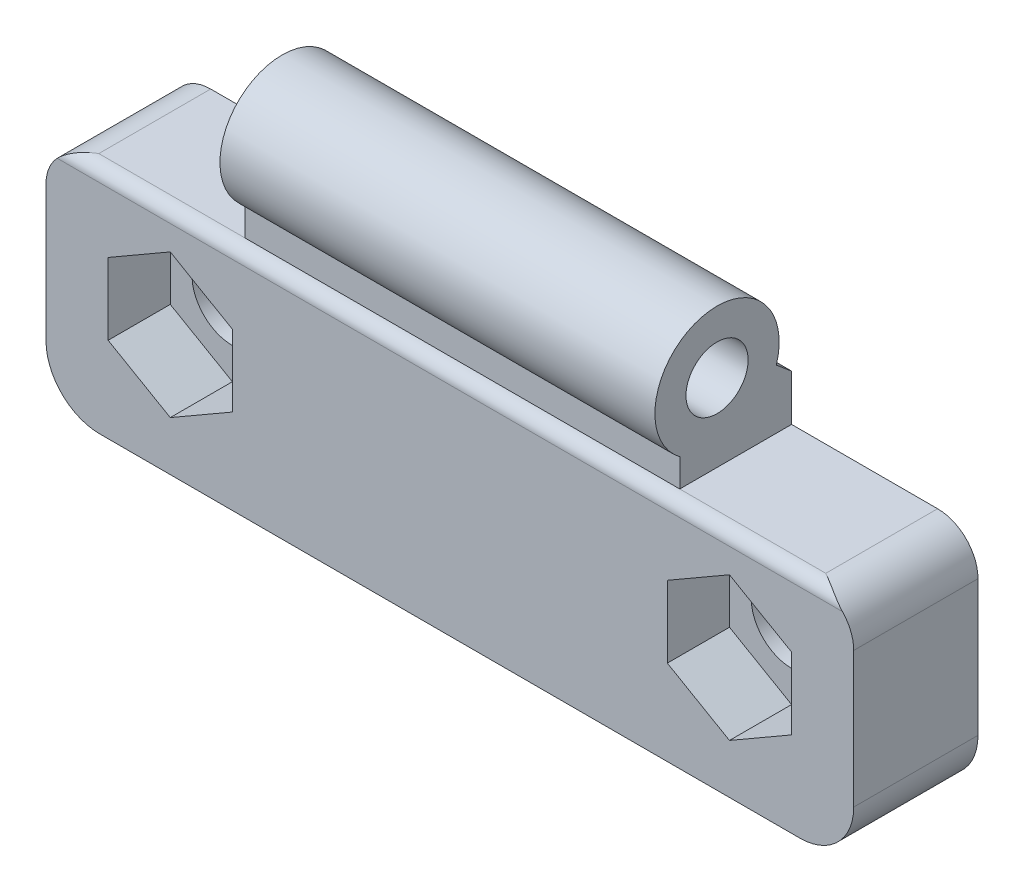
ISO-10303-21;
HEADER;
FILE_DESCRIPTION(('STEP AP214'),'2;1');
FILE_NAME('part.step','',(''),(''),'','','');
FILE_SCHEMA(('AUTOMOTIVE_DESIGN { 1 0 10303 214 1 1 1 1 }'));
ENDSEC;
DATA;
#1=APPLICATION_CONTEXT('core data for automotive mechanical design processes');
#2=APPLICATION_PROTOCOL_DEFINITION('international standard','automotive_design',2000,#1);
#3=PRODUCT_CONTEXT('',#1,'mechanical');
#4=PRODUCT('Part','Part','',(#3));
#5=PRODUCT_RELATED_PRODUCT_CATEGORY('part','',(#4));
#6=PRODUCT_DEFINITION_FORMATION('','',#4);
#7=PRODUCT_DEFINITION_CONTEXT('part definition',#1,'design');
#8=PRODUCT_DEFINITION('design','',#6,#7);
#9=PRODUCT_DEFINITION_SHAPE('','',#8);
#10=(LENGTH_UNIT() NAMED_UNIT(*) SI_UNIT(.MILLI.,.METRE.));
#11=(NAMED_UNIT(*) PLANE_ANGLE_UNIT() SI_UNIT($,.RADIAN.));
#12=(NAMED_UNIT(*) SI_UNIT($,.STERADIAN.) SOLID_ANGLE_UNIT());
#13=UNCERTAINTY_MEASURE_WITH_UNIT(LENGTH_MEASURE(1.E-05),#10,'distance_accuracy_value','');
#14=(GEOMETRIC_REPRESENTATION_CONTEXT(3) GLOBAL_UNCERTAINTY_ASSIGNED_CONTEXT((#13)) GLOBAL_UNIT_ASSIGNED_CONTEXT((#10,
#11,#12)) REPRESENTATION_CONTEXT('',''));
#15=CARTESIAN_POINT('',(0.,0.,0.));
#16=DIRECTION('',(0.,0.,1.));
#17=DIRECTION('',(1.,0.,0.));
#18=AXIS2_PLACEMENT_3D('',#15,#16,#17);
#19=CARTESIAN_POINT('',(45.,0.,5.));
#20=DIRECTION('',(0.,0.,1.));
#21=DIRECTION('',(1.,0.,0.));
#22=AXIS2_PLACEMENT_3D('',#19,#20,#21);
#23=CYLINDRICAL_SURFACE('',#22,3.25);
#24=CARTESIAN_POINT('',(45.,0.,0.));
#25=DIRECTION('',(0.,0.,1.));
#26=DIRECTION('',(1.,0.,0.));
#27=AXIS2_PLACEMENT_3D('',#24,#25,#26);
#28=CIRCLE('',#27,3.25);
#29=CARTESIAN_POINT('',(48.25,0.,0.));
#30=VERTEX_POINT('',#29);
#31=EDGE_CURVE('E313',#30,#30,#28,.F.);
#32=ORIENTED_EDGE('',*,*,#31,.T.);
#33=EDGE_LOOP('',(#32));
#34=FACE_BOUND('',#33,.T.);
#35=CARTESIAN_POINT('',(45.,0.,5.));
#36=DIRECTION('',(0.,0.,1.));
#37=DIRECTION('',(1.,0.,0.));
#38=AXIS2_PLACEMENT_3D('',#35,#36,#37);
#39=CIRCLE('',#38,3.25);
#40=CARTESIAN_POINT('',(48.25,0.,5.));
#41=VERTEX_POINT('',#40);
#42=EDGE_CURVE('E18',#41,#41,#39,.F.);
#43=ORIENTED_EDGE('',*,*,#42,.F.);
#44=EDGE_LOOP('',(#43));
#45=FACE_BOUND('',#44,.T.);
#46=ADVANCED_FACE('F14',(#34,#45),#23,.F.);
#47=CARTESIAN_POINT('',(0.,0.,5.));
#48=DIRECTION('',(0.,0.,1.));
#49=DIRECTION('',(1.,0.,0.));
#50=AXIS2_PLACEMENT_3D('',#47,#48,#49);
#51=CYLINDRICAL_SURFACE('',#50,3.25);
#52=CARTESIAN_POINT('',(0.,0.,0.));
#53=DIRECTION('',(0.,0.,1.));
#54=DIRECTION('',(1.,0.,0.));
#55=AXIS2_PLACEMENT_3D('',#52,#53,#54);
#56=CIRCLE('',#55,3.25);
#57=CARTESIAN_POINT('',(3.25,0.,0.));
#58=VERTEX_POINT('',#57);
#59=EDGE_CURVE('E325',#58,#58,#56,.F.);
#60=ORIENTED_EDGE('',*,*,#59,.T.);
#61=EDGE_LOOP('',(#60));
#62=FACE_BOUND('',#61,.T.);
#63=CARTESIAN_POINT('',(0.,0.,5.));
#64=DIRECTION('',(0.,0.,1.));
#65=DIRECTION('',(1.,0.,0.));
#66=AXIS2_PLACEMENT_3D('',#63,#64,#65);
#67=CIRCLE('',#66,3.25);
#68=CARTESIAN_POINT('',(3.25,0.,5.));
#69=VERTEX_POINT('',#68);
#70=EDGE_CURVE('E281',#69,#69,#67,.F.);
#71=ORIENTED_EDGE('',*,*,#70,.F.);
#72=EDGE_LOOP('',(#71));
#73=FACE_BOUND('',#72,.T.);
#74=ADVANCED_FACE('F474',(#62,#73),#51,.F.);
#75=CARTESIAN_POINT('',(40.,15.,6.));
#76=DIRECTION('',(1.,0.,0.));
#77=DIRECTION('',(0.,1.,0.));
#78=AXIS2_PLACEMENT_3D('',#75,#76,#77);
#79=CYLINDRICAL_SURFACE('',#78,5.);
#80=DIRECTION('',(1.,0.,0.));
#81=VECTOR('',#80,1.);
#82=CARTESIAN_POINT('',(40.,11.,9.));
#83=LINE('',#82,#81);
#84=CARTESIAN_POINT('',(40.,11.,9.));
#85=VERTEX_POINT('',#84);
#86=CARTESIAN_POINT('',(5.,11.,9.));
#87=VERTEX_POINT('',#86);
#88=EDGE_CURVE('E391',#85,#87,#83,.F.);
#89=ORIENTED_EDGE('',*,*,#88,.F.);
#90=CARTESIAN_POINT('',(40.,15.,6.));
#91=DIRECTION('',(1.,0.,0.));
#92=DIRECTION('',(0.,1.,0.));
#93=AXIS2_PLACEMENT_3D('',#90,#91,#92);
#94=CIRCLE('',#93,5.);
#95=CARTESIAN_POINT('',(40.,13.5,1.23030399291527));
#96=VERTEX_POINT('',#95);
#97=EDGE_CURVE('E382',#96,#85,#94,.T.);
#98=ORIENTED_EDGE('',*,*,#97,.F.);
#99=DIRECTION('',(1.,0.,0.));
#100=VECTOR('',#99,1.);
#101=CARTESIAN_POINT('',(40.,13.5,1.23030399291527));
#102=LINE('',#101,#100);
#103=CARTESIAN_POINT('',(5.,13.5,1.23030399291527));
#104=VERTEX_POINT('',#103);
#105=EDGE_CURVE('E377',#104,#96,#102,.T.);
#106=ORIENTED_EDGE('',*,*,#105,.F.);
#107=CARTESIAN_POINT('',(5.,15.,6.));
#108=DIRECTION('',(1.,0.,0.));
#109=DIRECTION('',(0.,1.,0.));
#110=AXIS2_PLACEMENT_3D('',#107,#108,#109);
#111=CIRCLE('',#110,5.);
#112=EDGE_CURVE('E363',#104,#87,#111,.T.);
#113=ORIENTED_EDGE('',*,*,#112,.T.);
#114=EDGE_LOOP('',(#89,#98,#106,#113));
#115=FACE_BOUND('',#114,.T.);
#116=ADVANCED_FACE('F16',(#115),#79,.T.);
#117=CARTESIAN_POINT('',(40.,11.,9.));
#118=DIRECTION('',(0.,0.,1.));
#119=DIRECTION('',(1.,0.,0.));
#120=AXIS2_PLACEMENT_3D('',#117,#118,#119);
#121=PLANE('',#120);
#122=ORIENTED_EDGE('',*,*,#88,.T.);
#123=DIRECTION('',(0.,1.,0.));
#124=VECTOR('',#123,1.);
#125=CARTESIAN_POINT('',(5.,15.,9.));
#126=LINE('',#125,#124);
#127=CARTESIAN_POINT('',(5.,8.75,9.));
#128=VERTEX_POINT('',#127);
#129=EDGE_CURVE('E360',#87,#128,#126,.F.);
#130=ORIENTED_EDGE('',*,*,#129,.T.);
#131=DIRECTION('',(1.,0.,0.));
#132=VECTOR('',#131,1.);
#133=CARTESIAN_POINT('',(55.,8.75,9.));
#134=LINE('',#133,#132);
#135=CARTESIAN_POINT('',(40.,8.75,9.));
#136=VERTEX_POINT('',#135);
#137=EDGE_CURVE('E390',#136,#128,#134,.F.);
#138=ORIENTED_EDGE('',*,*,#137,.F.);
#139=DIRECTION('',(0.,1.,0.));
#140=VECTOR('',#139,1.);
#141=CARTESIAN_POINT('',(40.,15.,9.));
#142=LINE('',#141,#140);
#143=EDGE_CURVE('E380',#85,#136,#142,.F.);
#144=ORIENTED_EDGE('',*,*,#143,.F.);
#145=EDGE_LOOP('',(#122,#130,#138,#144));
#146=FACE_BOUND('',#145,.T.);
#147=ADVANCED_FACE('F484',(#146),#121,.T.);
#148=CARTESIAN_POINT('',(40.,15.,6.));
#149=DIRECTION('',(1.,0.,0.));
#150=DIRECTION('',(0.,1.,0.));
#151=AXIS2_PLACEMENT_3D('',#148,#149,#150);
#152=CYLINDRICAL_SURFACE('',#151,2.5);
#153=CARTESIAN_POINT('',(5.,15.,6.));
#154=DIRECTION('',(1.,0.,0.));
#155=DIRECTION('',(0.,1.,0.));
#156=AXIS2_PLACEMENT_3D('',#153,#154,#155);
#157=CIRCLE('',#156,2.5);
#158=CARTESIAN_POINT('',(5.,17.5,6.));
#159=VERTEX_POINT('',#158);
#160=EDGE_CURVE('E353',#159,#159,#157,.F.);
#161=ORIENTED_EDGE('',*,*,#160,.T.);
#162=EDGE_LOOP('',(#161));
#163=FACE_BOUND('',#162,.T.);
#164=CARTESIAN_POINT('',(40.,15.,6.));
#165=DIRECTION('',(1.,0.,0.));
#166=DIRECTION('',(0.,1.,0.));
#167=AXIS2_PLACEMENT_3D('',#164,#165,#166);
#168=CIRCLE('',#167,2.5);
#169=CARTESIAN_POINT('',(40.,17.5,6.));
#170=VERTEX_POINT('',#169);
#171=EDGE_CURVE('E393',#170,#170,#168,.F.);
#172=ORIENTED_EDGE('',*,*,#171,.F.);
#173=EDGE_LOOP('',(#172));
#174=FACE_BOUND('',#173,.T.);
#175=ADVANCED_FACE('F706',(#163,#174),#152,.F.);
#176=CARTESIAN_POINT('',(22.5,15.,10.));
#177=DIRECTION('',(0.,0.,1.));
#178=DIRECTION('',(1.,0.,0.));
#179=AXIS2_PLACEMENT_3D('',#176,#177,#178);
#180=PLANE('',#179);
#181=DIRECTION('',(-0.866025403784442,0.5,0.));
#182=VECTOR('',#181,1.);
#183=CARTESIAN_POINT('',(50.,2.8867513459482,10.));
#184=LINE('',#183,#182);
#185=CARTESIAN_POINT('',(50.,2.8867513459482,10.));
#186=VERTEX_POINT('',#185);
#187=CARTESIAN_POINT('',(45.,5.77350269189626,10.));
#188=VERTEX_POINT('',#187);
#189=EDGE_CURVE('E31',#186,#188,#184,.T.);
#190=ORIENTED_EDGE('',*,*,#189,.F.);
#191=DIRECTION('',(0.,1.,0.));
#192=VECTOR('',#191,1.);
#193=CARTESIAN_POINT('',(50.,-2.8867513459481,10.));
#194=LINE('',#193,#192);
#195=CARTESIAN_POINT('',(50.,-2.8867513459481,10.));
#196=VERTEX_POINT('',#195);
#197=EDGE_CURVE('E211',#196,#186,#194,.T.);
#198=ORIENTED_EDGE('',*,*,#197,.F.);
#199=DIRECTION('',(0.866025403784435,0.500000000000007,0.));
#200=VECTOR('',#199,1.);
#201=CARTESIAN_POINT('',(45.,-5.77350269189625,10.));
#202=LINE('',#201,#200);
#203=CARTESIAN_POINT('',(45.,-5.77350269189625,10.));
#204=VERTEX_POINT('',#203);
#205=EDGE_CURVE('E214',#204,#196,#202,.T.);
#206=ORIENTED_EDGE('',*,*,#205,.F.);
#207=DIRECTION('',(0.866025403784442,-0.5,0.));
#208=VECTOR('',#207,1.);
#209=CARTESIAN_POINT('',(40.,-2.88675134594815,10.));
#210=LINE('',#209,#208);
#211=CARTESIAN_POINT('',(40.,-2.88675134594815,10.));
#212=VERTEX_POINT('',#211);
#213=EDGE_CURVE('E230',#212,#204,#210,.T.);
#214=ORIENTED_EDGE('',*,*,#213,.F.);
#215=DIRECTION('',(0.,-1.,0.));
#216=VECTOR('',#215,1.);
#217=CARTESIAN_POINT('',(40.,2.88675134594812,10.));
#218=LINE('',#217,#216);
#219=CARTESIAN_POINT('',(40.,2.88675134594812,10.));
#220=VERTEX_POINT('',#219);
#221=EDGE_CURVE('E227',#220,#212,#218,.T.);
#222=ORIENTED_EDGE('',*,*,#221,.F.);
#223=DIRECTION('',(-0.866025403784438,-0.5,0.));
#224=VECTOR('',#223,1.);
#225=CARTESIAN_POINT('',(45.,5.77350269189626,10.));
#226=LINE('',#225,#224);
#227=EDGE_CURVE('E225',#188,#220,#226,.T.);
#228=ORIENTED_EDGE('',*,*,#227,.F.);
#229=EDGE_LOOP('',(#190,#198,#206,#214,#222,#228));
#230=FACE_BOUND('',#229,.T.);
#231=DIRECTION('',(-0.866025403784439,0.5,0.));
#232=VECTOR('',#231,1.);
#233=CARTESIAN_POINT('',(5.,2.88675134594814,10.));
#234=LINE('',#233,#232);
#235=CARTESIAN_POINT('',(5.,2.88675134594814,10.));
#236=VERTEX_POINT('',#235);
#237=CARTESIAN_POINT('',(0.,5.77350269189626,10.));
#238=VERTEX_POINT('',#237);
#239=EDGE_CURVE('E39',#236,#238,#234,.T.);
#240=ORIENTED_EDGE('',*,*,#239,.F.);
#241=DIRECTION('',(0.,1.,0.));
#242=VECTOR('',#241,1.);
#243=CARTESIAN_POINT('',(5.,-2.8867513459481,10.));
#244=LINE('',#243,#242);
#245=CARTESIAN_POINT('',(5.,-2.8867513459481,10.));
#246=VERTEX_POINT('',#245);
#247=EDGE_CURVE('E248',#246,#236,#244,.T.);
#248=ORIENTED_EDGE('',*,*,#247,.F.);
#249=DIRECTION('',(0.866025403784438,0.5,0.));
#250=VECTOR('',#249,1.);
#251=CARTESIAN_POINT('',(0.,-5.77350269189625,10.));
#252=LINE('',#251,#250);
#253=CARTESIAN_POINT('',(0.,-5.77350269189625,10.));
#254=VERTEX_POINT('',#253);
#255=EDGE_CURVE('E274',#254,#246,#252,.T.);
#256=ORIENTED_EDGE('',*,*,#255,.F.);
#257=DIRECTION('',(0.866025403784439,-0.5,0.));
#258=VECTOR('',#257,1.);
#259=CARTESIAN_POINT('',(-5.,-2.88675134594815,10.));
#260=LINE('',#259,#258);
#261=CARTESIAN_POINT('',(-5.,-2.88675134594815,10.));
#262=VERTEX_POINT('',#261);
#263=EDGE_CURVE('E271',#262,#254,#260,.T.);
#264=ORIENTED_EDGE('',*,*,#263,.F.);
#265=DIRECTION('',(0.,-1.,0.));
#266=VECTOR('',#265,1.);
#267=CARTESIAN_POINT('',(-5.,2.88675134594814,10.));
#268=LINE('',#267,#266);
#269=CARTESIAN_POINT('',(-5.,2.88675134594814,10.));
#270=VERTEX_POINT('',#269);
#271=EDGE_CURVE('E268',#270,#262,#268,.T.);
#272=ORIENTED_EDGE('',*,*,#271,.F.);
#273=DIRECTION('',(-0.866025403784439,-0.5,0.));
#274=VECTOR('',#273,1.);
#275=CARTESIAN_POINT('',(0.,5.77350269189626,10.));
#276=LINE('',#275,#274);
#277=EDGE_CURVE('E265',#238,#270,#276,.T.);
#278=ORIENTED_EDGE('',*,*,#277,.F.);
#279=EDGE_LOOP('',(#240,#248,#256,#264,#272,#278));
#280=FACE_BOUND('',#279,.T.);
#281=CARTESIAN_POINT('',(51.75,5.5,10.));
#282=DIRECTION('',(0.,0.,-1.));
#283=DIRECTION('',(-1.,0.,0.));
#284=AXIS2_PLACEMENT_3D('',#281,#282,#283);
#285=CIRCLE('',#284,3.25);
#286=CARTESIAN_POINT('',(54.0952078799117,7.75,10.));
#287=VERTEX_POINT('',#286);
#288=CARTESIAN_POINT('',(55.,5.5,10.));
#289=VERTEX_POINT('',#288);
#290=EDGE_CURVE('E329',#287,#289,#285,.T.);
#291=ORIENTED_EDGE('',*,*,#290,.F.);
#292=DIRECTION('',(1.,0.,0.));
#293=VECTOR('',#292,1.);
#294=CARTESIAN_POINT('',(55.,7.75,10.));
#295=LINE('',#294,#293);
#296=CARTESIAN_POINT('',(-9.0952078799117,7.75,10.));
#297=VERTEX_POINT('',#296);
#298=EDGE_CURVE('E388',#297,#287,#295,.T.);
#299=ORIENTED_EDGE('',*,*,#298,.F.);
#300=CARTESIAN_POINT('',(-6.75,5.5,10.));
#301=DIRECTION('',(0.,0.,-1.));
#302=DIRECTION('',(-1.,0.,0.));
#303=AXIS2_PLACEMENT_3D('',#300,#301,#302);
#304=CIRCLE('',#303,3.25);
#305=CARTESIAN_POINT('',(-10.,5.5,10.));
#306=VERTEX_POINT('',#305);
#307=EDGE_CURVE('E348',#306,#297,#304,.T.);
#308=ORIENTED_EDGE('',*,*,#307,.F.);
#309=DIRECTION('',(0.,-1.,0.));
#310=VECTOR('',#309,1.);
#311=CARTESIAN_POINT('',(-10.,-5.4166666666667,10.));
#312=LINE('',#311,#310);
#313=CARTESIAN_POINT('',(-10.,-5.4166666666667,10.));
#314=VERTEX_POINT('',#313);
#315=EDGE_CURVE('E345',#314,#306,#312,.F.);
#316=ORIENTED_EDGE('',*,*,#315,.F.);
#317=CARTESIAN_POINT('',(-5.6666666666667,-5.4166666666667,10.));
#318=DIRECTION('',(0.,0.,-1.));
#319=DIRECTION('',(-1.,0.,0.));
#320=AXIS2_PLACEMENT_3D('',#317,#318,#319);
#321=CIRCLE('',#320,4.33333333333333);
#322=CARTESIAN_POINT('',(-5.6666666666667,-9.75,10.));
#323=VERTEX_POINT('',#322);
#324=EDGE_CURVE('E342',#323,#314,#321,.T.);
#325=ORIENTED_EDGE('',*,*,#324,.F.);
#326=DIRECTION('',(1.,0.,0.));
#327=VECTOR('',#326,1.);
#328=CARTESIAN_POINT('',(50.6666666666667,-9.75,10.));
#329=LINE('',#328,#327);
#330=CARTESIAN_POINT('',(50.6666666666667,-9.75,10.));
#331=VERTEX_POINT('',#330);
#332=EDGE_CURVE('E339',#331,#323,#329,.F.);
#333=ORIENTED_EDGE('',*,*,#332,.F.);
#334=CARTESIAN_POINT('',(50.6666666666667,-5.4166666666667,10.));
#335=DIRECTION('',(0.,0.,-1.));
#336=DIRECTION('',(-1.,0.,0.));
#337=AXIS2_PLACEMENT_3D('',#334,#335,#336);
#338=CIRCLE('',#337,4.33333333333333);
#339=CARTESIAN_POINT('',(55.,-5.4166666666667,10.));
#340=VERTEX_POINT('',#339);
#341=EDGE_CURVE('E336',#340,#331,#338,.T.);
#342=ORIENTED_EDGE('',*,*,#341,.F.);
#343=DIRECTION('',(0.,1.,0.));
#344=VECTOR('',#343,1.);
#345=CARTESIAN_POINT('',(55.,5.5,10.));
#346=LINE('',#345,#344);
#347=EDGE_CURVE('E333',#289,#340,#346,.F.);
#348=ORIENTED_EDGE('',*,*,#347,.F.);
#349=EDGE_LOOP('',(#291,#299,#308,#316,#325,#333,#342,#348));
#350=FACE_BOUND('',#349,.T.);
#351=ADVANCED_FACE('F438',(#230,#280,#350),#180,.T.);
#352=CARTESIAN_POINT('',(55.,7.75,9.));
#353=DIRECTION('',(1.,0.,0.));
#354=DIRECTION('',(0.,1.,0.));
#355=AXIS2_PLACEMENT_3D('',#352,#353,#354);
#356=CYLINDRICAL_SURFACE('',#355,1.);
#357=ORIENTED_EDGE('',*,*,#137,.T.);
#358=DIRECTION('',(-1.,0.,0.));
#359=VECTOR('',#358,1.);
#360=CARTESIAN_POINT('',(-6.75,8.75,9.));
#361=LINE('',#360,#359);
#362=CARTESIAN_POINT('',(-6.75,8.75,9.));
#363=VERTEX_POINT('',#362);
#364=EDGE_CURVE('E352',#363,#128,#361,.F.);
#365=ORIENTED_EDGE('',*,*,#364,.F.);
#366=CARTESIAN_POINT('',(-9.0952078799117,7.75,10.));
#367=CARTESIAN_POINT('',(-9.05730541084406,7.7895153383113,9.9999877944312));
#368=CARTESIAN_POINT('',(-9.01844303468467,7.82801385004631,9.99766050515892));
#369=CARTESIAN_POINT('',(-8.9391426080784,7.90272925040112,9.98898430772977));
#370=CARTESIAN_POINT('',(-8.89870771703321,7.93895036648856,9.9826431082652));
#371=CARTESIAN_POINT('',(-8.77612768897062,8.04337299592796,9.95864810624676));
#372=CARTESIAN_POINT('',(-8.69196734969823,8.10810030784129,9.93599885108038));
#373=CARTESIAN_POINT('',(-8.54229248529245,8.21223956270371,9.88809834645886));
#374=CARTESIAN_POINT('',(-8.47756518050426,8.25387573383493,9.86502360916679));
#375=CARTESIAN_POINT('',(-8.34656824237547,8.33183254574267,9.81463038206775));
#376=CARTESIAN_POINT('',(-8.28029817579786,8.3681516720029,9.78731068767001));
#377=CARTESIAN_POINT('',(-8.07896601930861,8.46968556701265,9.70004516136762));
#378=CARTESIAN_POINT('',(-7.94205678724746,8.52701481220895,9.63502639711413));
#379=CARTESIAN_POINT('',(-7.71806304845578,8.60380340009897,9.52318018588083));
#380=CARTESIAN_POINT('',(-7.63173288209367,8.62938347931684,9.47878152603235));
#381=CARTESIAN_POINT('',(-7.45833118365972,8.67313159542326,9.38778607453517));
#382=CARTESIAN_POINT('',(-7.37125941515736,8.69129717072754,9.34118855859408));
#383=CARTESIAN_POINT('',(-7.10989463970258,8.73482587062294,9.199610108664));
#384=CARTESIAN_POINT('',(-6.93477453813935,8.74944876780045,9.10249403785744));
#385=CARTESIAN_POINT('',(-6.75664691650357,8.74999489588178,9.00368703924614));
#386=CARTESIAN_POINT('',(-6.75332339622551,8.74999999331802,9.00184348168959));
#387=CARTESIAN_POINT('',(-6.75,8.75,9.));
#388=B_SPLINE_CURVE_WITH_KNOTS('',3,(#366,#367,#368,#369,#370,#371,#372,#373,#374,#375,#376,
#377,#378,#379,#380,#381,#382,#383,#384,#385,#386,#387),.UNSPECIFIED.,.F.,.F.,(4,2,2,2,2,2,2,2,
2,2,4),(0.,0.164087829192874,0.327861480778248,0.652251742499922,0.893004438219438,
1.13382557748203,1.61798965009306,1.91890595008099,2.21992207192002,2.81958905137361,
2.83099081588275),.UNSPECIFIED.);
#389=EDGE_CURVE('E349',#297,#363,#388,.T.);
#390=ORIENTED_EDGE('',*,*,#389,.F.);
#391=ORIENTED_EDGE('',*,*,#298,.T.);
#392=CARTESIAN_POINT('',(51.75,8.75,9.));
#393=CARTESIAN_POINT('',(51.750000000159,8.75,9.00000117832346));
#394=CARTESIAN_POINT('',(51.7500001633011,8.74999999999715,9.00000235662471));
#395=CARTESIAN_POINT('',(51.7500007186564,8.74999999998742,9.00000466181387));
#396=CARTESIAN_POINT('',(51.7500011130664,8.74999999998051,9.00000578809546));
#397=CARTESIAN_POINT('',(51.7500020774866,8.7499999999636,9.00000801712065));
#398=CARTESIAN_POINT('',(51.7500026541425,8.74999999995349,9.00000911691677));
#399=CARTESIAN_POINT('',(51.7500039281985,8.74999999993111,9.00001123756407));
#400=CARTESIAN_POINT('',(51.7500046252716,8.74999999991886,9.00001225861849));
#401=CARTESIAN_POINT('',(51.7500070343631,8.74999999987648,9.00001550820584));
#402=CARTESIAN_POINT('',(51.7500089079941,8.74999999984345,9.00001761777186));
#403=CARTESIAN_POINT('',(51.750012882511,8.74999999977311,9.00002152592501));
#404=CARTESIAN_POINT('',(51.7500149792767,8.74999999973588,9.0000233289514));
#405=CARTESIAN_POINT('',(51.7500227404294,8.74999999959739,9.00002964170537));
#406=CARTESIAN_POINT('',(51.7500286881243,8.74999999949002,9.00003381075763));
#407=CARTESIAN_POINT('',(51.7500407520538,8.74999999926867,9.00004104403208));
#408=CARTESIAN_POINT('',(51.750046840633,8.7499999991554,9.00004415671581));
#409=CARTESIAN_POINT('',(51.7500714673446,8.74999999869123,9.00005650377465));
#410=CARTESIAN_POINT('',(51.7500901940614,8.74999999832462,9.00006534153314));
#411=CARTESIAN_POINT('',(51.7501260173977,8.74999999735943,9.00008036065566));
#412=CARTESIAN_POINT('',(51.7501430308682,8.74999999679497,9.0000867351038));
#413=CARTESIAN_POINT('',(51.7502605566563,8.74999999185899,9.00013459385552));
#414=CARTESIAN_POINT('',(51.750353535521,8.74999998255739,9.00019236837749));
#415=CARTESIAN_POINT('',(51.7507067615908,8.74999993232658,9.00040313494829));
#416=CARTESIAN_POINT('',(51.7509723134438,8.74999986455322,9.00054402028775));
#417=CARTESIAN_POINT('',(51.751973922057,8.74999948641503,9.00108409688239));
#418=CARTESIAN_POINT('',(51.7527045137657,8.74999895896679,9.00149587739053));
#419=CARTESIAN_POINT('',(51.755609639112,8.74999587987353,9.00312450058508));
#420=CARTESIAN_POINT('',(51.7577901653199,8.74999138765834,9.00432740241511));
#421=CARTESIAN_POINT('',(51.8142959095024,8.74981822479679,9.03551019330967));
#422=CARTESIAN_POINT('',(51.8685340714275,8.74829247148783,9.06570560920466));
#423=CARTESIAN_POINT('',(51.9752670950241,8.7426091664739,9.12484934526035));
#424=CARTESIAN_POINT('',(52.0277621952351,8.73853740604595,9.15380664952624));
#425=CARTESIAN_POINT('',(52.138025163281,8.72727707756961,9.21440766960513));
#426=CARTESIAN_POINT('',(52.1957815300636,8.71981163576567,9.24602225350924));
#427=CARTESIAN_POINT('',(52.3116164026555,8.70164845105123,9.3089473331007));
#428=CARTESIAN_POINT('',(52.3696933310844,8.69092311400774,9.34025277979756));
#429=CARTESIAN_POINT('',(52.4726690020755,8.66896978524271,9.39517476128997));
#430=CARTESIAN_POINT('',(52.5176206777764,8.65838628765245,9.41895027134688));
#431=CARTESIAN_POINT('',(52.6072273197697,8.63525089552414,9.46584668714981));
#432=CARTESIAN_POINT('',(52.6518827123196,8.622703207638,9.4889688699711));
#433=CARTESIAN_POINT('',(52.7838215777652,8.58254100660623,9.5563986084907));
#434=CARTESIAN_POINT('',(52.8707827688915,8.55204531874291,9.59968582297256));
#435=CARTESIAN_POINT('',(53.0153504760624,8.49421605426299,9.66892817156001));
#436=CARTESIAN_POINT('',(53.0733294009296,8.46906521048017,9.69595094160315));
#437=CARTESIAN_POINT('',(53.1887786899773,8.41487555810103,9.74790084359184));
#438=CARTESIAN_POINT('',(53.2462457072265,8.38582017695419,9.77281826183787));
#439=CARTESIAN_POINT('',(53.3626154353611,8.32250617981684,9.8209038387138));
#440=CARTESIAN_POINT('',(53.4214764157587,8.28807974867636,9.84395383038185));
#441=CARTESIAN_POINT('',(53.5377651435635,8.21497829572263,9.88632781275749));
#442=CARTESIAN_POINT('',(53.5951947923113,8.17630932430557,9.90565700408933));
#443=CARTESIAN_POINT('',(53.7325786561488,8.07716921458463,9.94707942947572));
#444=CARTESIAN_POINT('',(53.8116625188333,8.01444633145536,9.96681970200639));
#445=CARTESIAN_POINT('',(53.9641010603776,7.88125053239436,9.99364572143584));
#446=CARTESIAN_POINT('',(54.0375069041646,7.81086530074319,10.0008613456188));
#447=CARTESIAN_POINT('',(54.1590949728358,7.68275441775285,9.99922091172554));
#448=CARTESIAN_POINT('',(54.2088674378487,7.62650578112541,9.99406109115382));
#449=CARTESIAN_POINT('',(54.3035682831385,7.51178953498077,9.97295942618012));
#450=CARTESIAN_POINT('',(54.3484947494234,7.453321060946,9.95701333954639));
#451=CARTESIAN_POINT('',(54.4247440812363,7.34708824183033,9.91667212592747));
#452=CARTESIAN_POINT('',(54.4570632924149,7.2992779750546,9.89429577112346));
#453=CARTESIAN_POINT('',(54.5169680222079,7.20571577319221,9.84062859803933));
#454=CARTESIAN_POINT('',(54.5445566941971,7.15996248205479,9.8093437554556));
#455=CARTESIAN_POINT('',(54.5947264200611,7.07244933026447,9.73765989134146));
#456=CARTESIAN_POINT('',(54.6172752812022,7.0307160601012,9.69720542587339));
#457=CARTESIAN_POINT('',(54.6569565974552,6.95395246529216,9.60808018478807));
#458=CARTESIAN_POINT('',(54.6740907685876,6.9189200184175,9.55941201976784));
#459=CARTESIAN_POINT('',(54.7014522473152,6.86100920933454,9.46107729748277));
#460=CARTESIAN_POINT('',(54.7122281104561,6.83722330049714,9.41209515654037));
#461=CARTESIAN_POINT('',(54.7297159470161,6.797791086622,9.31028193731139));
#462=CARTESIAN_POINT('',(54.7364292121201,6.78214219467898,9.2574520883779));
#463=CARTESIAN_POINT('',(54.7457170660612,6.76028307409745,9.15231432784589));
#464=CARTESIAN_POINT('',(54.748482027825,6.75363952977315,9.10011269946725));
#465=CARTESIAN_POINT('',(54.750569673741,6.74863517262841,8.99524785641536));
#466=CARTESIAN_POINT('',(54.7498927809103,6.75027334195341,8.94258469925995));
#467=CARTESIAN_POINT('',(54.7451041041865,6.76170045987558,8.83889265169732));
#468=CARTESIAN_POINT('',(54.7410296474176,6.77140082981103,8.78785223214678));
#469=CARTESIAN_POINT('',(54.7293931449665,6.79843412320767,8.68825570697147));
#470=CARTESIAN_POINT('',(54.7218312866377,6.81576663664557,8.63969946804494));
#471=CARTESIAN_POINT('',(54.70303954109,6.85741604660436,8.54621298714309));
#472=CARTESIAN_POINT('',(54.6917952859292,6.8817602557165,8.50129782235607));
#473=CARTESIAN_POINT('',(54.6655269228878,6.93635552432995,8.41645198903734));
#474=CARTESIAN_POINT('',(54.650502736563,6.96660670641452,8.37652142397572));
#475=CARTESIAN_POINT('',(54.6162062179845,7.03257126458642,8.30153498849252));
#476=CARTESIAN_POINT('',(54.5968345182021,7.06840516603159,8.26663099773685));
#477=CARTESIAN_POINT('',(54.5541983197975,7.14342108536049,8.20346430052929));
#478=CARTESIAN_POINT('',(54.5309333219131,7.1826035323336,8.17520244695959));
#479=CARTESIAN_POINT('',(54.4788589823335,7.26590351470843,8.12351113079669));
#480=CARTESIAN_POINT('',(54.4497624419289,7.31016969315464,8.10061311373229));
#481=CARTESIAN_POINT('',(54.3878223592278,7.39930311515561,8.06225140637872));
#482=CARTESIAN_POINT('',(54.3549750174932,7.44417092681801,8.04679533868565));
#483=CARTESIAN_POINT('',(54.2701213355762,7.5538339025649,8.01711213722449));
#484=CARTESIAN_POINT('',(54.2162745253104,7.61825889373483,8.00675166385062));
#485=CARTESIAN_POINT('',(54.1034197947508,7.74299627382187,7.99806667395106));
#486=CARTESIAN_POINT('',(54.0444133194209,7.80330980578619,7.99973879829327));
#487=CARTESIAN_POINT('',(53.8971239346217,7.94262986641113,8.01529312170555));
#488=CARTESIAN_POINT('',(53.806863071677,8.01899156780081,8.03395966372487));
#489=CARTESIAN_POINT('',(53.6199229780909,8.16081113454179,8.08511775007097));
#490=CARTESIAN_POINT('',(53.5231687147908,8.22609155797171,8.11780914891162));
#491=CARTESIAN_POINT('',(53.3494770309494,8.33052583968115,8.18400406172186));
#492=CARTESIAN_POINT('',(53.2732539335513,8.37220929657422,8.21549370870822));
#493=CARTESIAN_POINT('',(53.1191347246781,8.44879473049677,8.28285773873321));
#494=CARTESIAN_POINT('',(53.0412354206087,8.48368220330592,8.31874123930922));
#495=CARTESIAN_POINT('',(52.8890101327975,8.54491064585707,8.39152526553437));
#496=CARTESIAN_POINT('',(52.8147474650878,8.57163673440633,8.42823810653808));
#497=CARTESIAN_POINT('',(52.6659855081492,8.61921919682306,8.50358292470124));
#498=CARTESIAN_POINT('',(52.5914909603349,8.64011289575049,8.54220074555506));
#499=CARTESIAN_POINT('',(52.4619813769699,8.67155458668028,8.61045314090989));
#500=CARTESIAN_POINT('',(52.4070811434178,8.68337518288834,8.63973024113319));
#501=CARTESIAN_POINT('',(52.2958918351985,8.70433625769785,8.69955351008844));
#502=CARTESIAN_POINT('',(52.2395982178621,8.71341384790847,8.73011342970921));
#503=CARTESIAN_POINT('',(52.1463818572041,8.72595159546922,8.78102876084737));
#504=CARTESIAN_POINT('',(52.1095002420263,8.73026850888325,8.80125407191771));
#505=CARTESIAN_POINT('',(52.036010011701,8.7375995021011,8.84168076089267));
#506=CARTESIAN_POINT('',(51.9994017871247,8.74062450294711,8.86188083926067));
#507=CARTESIAN_POINT('',(51.9295353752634,8.74520810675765,8.90048050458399));
#508=CARTESIAN_POINT('',(51.8962805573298,8.74687647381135,8.91887378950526));
#509=CARTESIAN_POINT('',(51.8286924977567,8.74922916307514,8.95637649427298));
#510=CARTESIAN_POINT('',(51.794359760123,8.74987931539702,8.97548957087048));
#511=CARTESIAN_POINT('',(51.757791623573,8.74999138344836,8.9956719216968));
#512=CARTESIAN_POINT('',(51.7556124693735,8.74999587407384,8.99687396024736));
#513=CARTESIAN_POINT('',(51.7527077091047,8.7499989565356,8.99850234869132));
#514=CARTESIAN_POINT('',(51.7519760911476,8.74999948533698,8.99891471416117));
#515=CARTESIAN_POINT('',(51.750973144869,8.74999986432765,8.99945551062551));
#516=CARTESIAN_POINT('',(51.7507072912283,8.74999993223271,8.99959655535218));
#517=CARTESIAN_POINT('',(51.7503537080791,8.74999998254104,8.99980753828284));
#518=CARTESIAN_POINT('',(51.7502606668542,8.74999999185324,8.99986535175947));
#519=CARTESIAN_POINT('',(51.750143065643,8.74999999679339,8.99991323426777));
#520=CARTESIAN_POINT('',(51.7501260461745,8.74999999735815,8.99991960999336));
#521=CARTESIAN_POINT('',(51.750090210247,8.74999999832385,8.99993463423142));
#522=CARTESIAN_POINT('',(51.7500714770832,8.74999999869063,8.99994347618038));
#523=CARTESIAN_POINT('',(51.7500468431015,8.74999999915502,8.9999558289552));
#524=CARTESIAN_POINT('',(51.7500407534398,8.74999999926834,8.99995894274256));
#525=CARTESIAN_POINT('',(51.7500286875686,8.74999999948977,8.99996617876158));
#526=CARTESIAN_POINT('',(51.7500227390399,8.74999999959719,8.99997034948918));
#527=CARTESIAN_POINT('',(51.7500149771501,8.74999999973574,8.9999766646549));
#528=CARTESIAN_POINT('',(51.7500128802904,8.74999999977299,8.99997846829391));
#529=CARTESIAN_POINT('',(51.7500089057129,8.74999999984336,8.99998237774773));
#530=CARTESIAN_POINT('',(51.750007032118,8.7499999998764,8.99998448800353));
#531=CARTESIAN_POINT('',(51.7500046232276,8.7499999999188,8.99998773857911));
#532=CARTESIAN_POINT('',(51.7500039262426,8.74999999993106,8.9999887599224));
#533=CARTESIAN_POINT('',(51.7500026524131,8.74999999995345,8.99999088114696));
#534=CARTESIAN_POINT('',(51.7500020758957,8.74999999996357,8.99999198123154));
#535=CARTESIAN_POINT('',(51.7500011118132,8.7499999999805,8.99999421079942));
#536=CARTESIAN_POINT('',(51.7500007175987,8.74999999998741,8.99999533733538));
#537=CARTESIAN_POINT('',(51.7500001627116,8.74999999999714,8.99999764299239));
#538=CARTESIAN_POINT('',(51.7499999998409,8.75,8.9999988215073));
#539=CARTESIAN_POINT('',(51.75,8.75,9.));
#540=B_SPLINE_CURVE_WITH_KNOTS('',3,(#392,#393,#394,#395,#396,#397,#398,#399,#400,#401,#402,
#403,#404,#405,#406,#407,#408,#409,#410,#411,#412,#413,#414,#415,#416,#417,#418,#419,#420,#421,
#422,#423,#424,#425,#426,#427,#428,#429,#430,#431,#432,#433,#434,#435,#436,#437,#438,#439,#440,
#441,#442,#443,#444,#445,#446,#447,#448,#449,#450,#451,#452,#453,#454,#455,#456,#457,#458,#459,
#460,#461,#462,#463,#464,#465,#466,#467,#468,#469,#470,#471,#472,#473,#474,#475,#476,#477,#478,
#479,#480,#481,#482,#483,#484,#485,#486,#487,#488,#489,#490,#491,#492,#493,#494,#495,#496,#497,
#498,#499,#500,#501,#502,#503,#504,#505,#506,#507,#508,#509,#510,#511,#512,#513,#514,#515,#516,
#517,#518,#519,#520,#521,#522,#523,#524,#525,#526,#527,#528,#529,#530,#531,#532,#533,#534,#535,
#536,#537,#538,#539),.UNSPECIFIED.,.T.,.F.,(4,2,2,2,2,2,2,2,2,2,2,2,2,2,2,2,2,2,2,2,2,2,2,2,2,2,
2,2,2,2,2,2,2,2,2,2,2,2,2,2,2,2,2,2,2,2,2,2,2,2,2,2,2,2,2,2,2,2,2,2,2,2,2,2,2,2,2,2,2,2,2,2,2,
4),(0.,3.53115691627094E-06,7.09641137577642E-06,1.08105630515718E-05,1.45147823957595E-05,
2.29382984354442E-05,3.1226912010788E-05,5.29263216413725E-05,7.34219142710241E-05,
0.000135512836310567,0.00018995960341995,0.000516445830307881,0.00141973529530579,
0.00393389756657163,0.0114065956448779,0.19759245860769,0.377819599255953,0.576534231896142,
0.776980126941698,0.932762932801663,1.08821655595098,1.39323247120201,1.59931412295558,
1.80629986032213,2.02201901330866,2.23743442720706,2.5449721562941,2.84930131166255,
3.07437204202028,3.29953134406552,3.48445927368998,3.66926344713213,3.85521634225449,
4.04111024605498,4.20678395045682,4.37240495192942,4.52973428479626,4.6870442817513,
4.84264842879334,4.99824421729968,5.15445448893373,5.3106680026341,5.4709013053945,
5.63115517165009,5.80360488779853,5.97623086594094,6.22860879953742,6.48091627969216,
6.83805128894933,7.20045395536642,7.47729774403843,7.75472605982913,8.01564030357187,
8.27484437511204,8.46477475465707,8.65877682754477,8.78561256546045,8.91135380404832,
9.02546329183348,9.14332582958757,9.15079369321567,9.15331139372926,9.15421570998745,
9.15454241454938,9.15459687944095,9.15465899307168,9.15467949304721,9.15470119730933,
9.15470948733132,9.15471791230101,9.15472161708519,9.15472533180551,9.15472889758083,
9.15473242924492),.UNSPECIFIED.);
#541=CARTESIAN_POINT('',(51.75,8.75,9.));
#542=VERTEX_POINT('',#541);
#543=EDGE_CURVE('E332',#542,#287,#540,.T.);
#544=ORIENTED_EDGE('',*,*,#543,.F.);
#545=DIRECTION('',(-1.,0.,0.));
#546=VECTOR('',#545,1.);
#547=CARTESIAN_POINT('',(-6.75,8.75,9.));
#548=LINE('',#547,#546);
#549=EDGE_CURVE('E314',#136,#542,#548,.F.);
#550=ORIENTED_EDGE('',*,*,#549,.F.);
#551=EDGE_LOOP('',(#357,#365,#390,#391,#544,#550));
#552=FACE_BOUND('',#551,.T.);
#553=ADVANCED_FACE('F432',(#552),#356,.T.);
#554=CARTESIAN_POINT('',(40.,15.,0.));
#555=DIRECTION('',(1.,0.,0.));
#556=DIRECTION('',(0.,1.,0.));
#557=AXIS2_PLACEMENT_3D('',#554,#555,#556);
#558=PLANE('',#557);
#559=ORIENTED_EDGE('',*,*,#97,.T.);
#560=ORIENTED_EDGE('',*,*,#143,.T.);
#561=DIRECTION('',(0.,0.,1.));
#562=VECTOR('',#561,1.);
#563=CARTESIAN_POINT('',(40.,8.75,0.));
#564=LINE('',#563,#562);
#565=CARTESIAN_POINT('',(40.,8.75,0.));
#566=VERTEX_POINT('',#565);
#567=EDGE_CURVE('E315',#566,#136,#564,.T.);
#568=ORIENTED_EDGE('',*,*,#567,.F.);
#569=DIRECTION('',(0.,1.,0.));
#570=VECTOR('',#569,1.);
#571=CARTESIAN_POINT('',(40.,15.,0.));
#572=LINE('',#571,#570);
#573=CARTESIAN_POINT('',(40.,12.4676523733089,0.));
#574=VERTEX_POINT('',#573);
#575=EDGE_CURVE('E321',#566,#574,#572,.T.);
#576=ORIENTED_EDGE('',*,*,#575,.T.);
#577=DIRECTION('',(0.,0.64278760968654,0.766044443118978));
#578=VECTOR('',#577,1.);
#579=CARTESIAN_POINT('',(40.,12.4676523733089,0.));
#580=LINE('',#579,#578);
#581=EDGE_CURVE('E369',#96,#574,#580,.F.);
#582=ORIENTED_EDGE('',*,*,#581,.F.);
#583=EDGE_LOOP('',(#559,#560,#568,#576,#582));
#584=FACE_BOUND('',#583,.T.);
#585=ORIENTED_EDGE('',*,*,#171,.T.);
#586=EDGE_LOOP('',(#585));
#587=FACE_BOUND('',#586,.T.);
#588=ADVANCED_FACE('F437',(#584,#587),#558,.T.);
#589=CARTESIAN_POINT('',(40.,12.4676523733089,0.));
#590=DIRECTION('',(0.,0.766044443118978,-0.64278760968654));
#591=DIRECTION('',(0.,0.64278760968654,0.766044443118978));
#592=AXIS2_PLACEMENT_3D('',#589,#590,#591);
#593=PLANE('',#592);
#594=ORIENTED_EDGE('',*,*,#581,.T.);
#595=DIRECTION('',(1.,0.,0.));
#596=VECTOR('',#595,1.);
#597=CARTESIAN_POINT('',(22.5,12.4676523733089,0.));
#598=LINE('',#597,#596);
#599=CARTESIAN_POINT('',(5.,12.4676523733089,0.));
#600=VERTEX_POINT('',#599);
#601=EDGE_CURVE('E324',#574,#600,#598,.F.);
#602=ORIENTED_EDGE('',*,*,#601,.T.);
#603=DIRECTION('',(0.,0.64278760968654,0.766044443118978));
#604=VECTOR('',#603,1.);
#605=CARTESIAN_POINT('',(5.,12.4676523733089,0.));
#606=LINE('',#605,#604);
#607=EDGE_CURVE('E366',#600,#104,#606,.T.);
#608=ORIENTED_EDGE('',*,*,#607,.T.);
#609=ORIENTED_EDGE('',*,*,#105,.T.);
#610=EDGE_LOOP('',(#594,#602,#608,#609));
#611=FACE_BOUND('',#610,.T.);
#612=ADVANCED_FACE('F467',(#611),#593,.T.);
#613=CARTESIAN_POINT('',(5.,15.,0.));
#614=DIRECTION('',(1.,0.,0.));
#615=DIRECTION('',(0.,1.,0.));
#616=AXIS2_PLACEMENT_3D('',#613,#614,#615);
#617=PLANE('',#616);
#618=ORIENTED_EDGE('',*,*,#160,.F.);
#619=EDGE_LOOP('',(#618));
#620=FACE_BOUND('',#619,.T.);
#621=ORIENTED_EDGE('',*,*,#129,.F.);
#622=ORIENTED_EDGE('',*,*,#112,.F.);
#623=ORIENTED_EDGE('',*,*,#607,.F.);
#624=DIRECTION('',(0.,1.,0.));
#625=VECTOR('',#624,1.);
#626=CARTESIAN_POINT('',(5.,15.,0.));
#627=LINE('',#626,#625);
#628=CARTESIAN_POINT('',(5.,8.75,0.));
#629=VERTEX_POINT('',#628);
#630=EDGE_CURVE('E308',#600,#629,#627,.F.);
#631=ORIENTED_EDGE('',*,*,#630,.T.);
#632=DIRECTION('',(0.,0.,1.));
#633=VECTOR('',#632,1.);
#634=CARTESIAN_POINT('',(5.,8.75,0.));
#635=LINE('',#634,#633);
#636=EDGE_CURVE('E350',#128,#629,#635,.F.);
#637=ORIENTED_EDGE('',*,*,#636,.F.);
#638=EDGE_LOOP('',(#621,#622,#623,#631,#637));
#639=FACE_BOUND('',#638,.T.);
#640=ADVANCED_FACE('F463',(#620,#639),#617,.F.);
#641=CARTESIAN_POINT('',(-6.75,8.75,0.));
#642=DIRECTION('',(0.,1.,0.));
#643=DIRECTION('',(-1.,0.,0.));
#644=AXIS2_PLACEMENT_3D('',#641,#642,#643);
#645=PLANE('',#644);
#646=DIRECTION('',(0.,0.,-1.));
#647=VECTOR('',#646,1.);
#648=CARTESIAN_POINT('',(-6.75,8.75,0.));
#649=LINE('',#648,#647);
#650=CARTESIAN_POINT('',(-6.75,8.75,0.));
#651=VERTEX_POINT('',#650);
#652=EDGE_CURVE('E346',#363,#651,#649,.T.);
#653=ORIENTED_EDGE('',*,*,#652,.F.);
#654=ORIENTED_EDGE('',*,*,#364,.T.);
#655=ORIENTED_EDGE('',*,*,#636,.T.);
#656=DIRECTION('',(1.,0.,0.));
#657=VECTOR('',#656,1.);
#658=CARTESIAN_POINT('',(22.5,8.75,0.));
#659=LINE('',#658,#657);
#660=EDGE_CURVE('E305',#629,#651,#659,.F.);
#661=ORIENTED_EDGE('',*,*,#660,.T.);
#662=EDGE_LOOP('',(#653,#654,#655,#661));
#663=FACE_BOUND('',#662,.T.);
#664=ADVANCED_FACE('F458',(#663),#645,.T.);
#665=CARTESIAN_POINT('',(-6.75,5.5,0.));
#666=DIRECTION('',(0.,0.,-1.));
#667=DIRECTION('',(-1.,0.,0.));
#668=AXIS2_PLACEMENT_3D('',#665,#666,#667);
#669=CYLINDRICAL_SURFACE('',#668,3.25);
#670=DIRECTION('',(0.,0.,1.));
#671=VECTOR('',#670,1.);
#672=CARTESIAN_POINT('',(-10.,5.5,0.));
#673=LINE('',#672,#671);
#674=CARTESIAN_POINT('',(-10.,5.5,0.));
#675=VERTEX_POINT('',#674);
#676=EDGE_CURVE('E343',#306,#675,#673,.F.);
#677=ORIENTED_EDGE('',*,*,#676,.F.);
#678=ORIENTED_EDGE('',*,*,#307,.T.);
#679=ORIENTED_EDGE('',*,*,#389,.T.);
#680=ORIENTED_EDGE('',*,*,#652,.T.);
#681=CARTESIAN_POINT('',(-6.75,5.5,0.));
#682=DIRECTION('',(0.,0.,-1.));
#683=DIRECTION('',(-1.,0.,0.));
#684=AXIS2_PLACEMENT_3D('',#681,#682,#683);
#685=CIRCLE('',#684,3.25);
#686=EDGE_CURVE('E304',#651,#675,#685,.F.);
#687=ORIENTED_EDGE('',*,*,#686,.T.);
#688=EDGE_LOOP('',(#677,#678,#679,#680,#687));
#689=FACE_BOUND('',#688,.T.);
#690=ADVANCED_FACE('F452',(#689),#669,.T.);
#691=CARTESIAN_POINT('',(-10.,-5.4166666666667,0.));
#692=DIRECTION('',(-1.,0.,0.));
#693=DIRECTION('',(0.,-1.,0.));
#694=AXIS2_PLACEMENT_3D('',#691,#692,#693);
#695=PLANE('',#694);
#696=DIRECTION('',(0.,1.,0.));
#697=VECTOR('',#696,1.);
#698=CARTESIAN_POINT('',(-10.,15.,0.));
#699=LINE('',#698,#697);
#700=CARTESIAN_POINT('',(-10.,-5.4166666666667,0.));
#701=VERTEX_POINT('',#700);
#702=EDGE_CURVE('E301',#675,#701,#699,.F.);
#703=ORIENTED_EDGE('',*,*,#702,.T.);
#704=DIRECTION('',(0.,0.,-1.));
#705=VECTOR('',#704,1.);
#706=CARTESIAN_POINT('',(-10.,-5.4166666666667,0.));
#707=LINE('',#706,#705);
#708=EDGE_CURVE('E340',#314,#701,#707,.T.);
#709=ORIENTED_EDGE('',*,*,#708,.F.);
#710=ORIENTED_EDGE('',*,*,#315,.T.);
#711=ORIENTED_EDGE('',*,*,#676,.T.);
#712=EDGE_LOOP('',(#703,#709,#710,#711));
#713=FACE_BOUND('',#712,.T.);
#714=ADVANCED_FACE('F457',(#713),#695,.T.);
#715=CARTESIAN_POINT('',(-5.6666666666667,-5.4166666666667,0.));
#716=DIRECTION('',(0.,0.,-1.));
#717=DIRECTION('',(-1.,0.,0.));
#718=AXIS2_PLACEMENT_3D('',#715,#716,#717);
#719=CYLINDRICAL_SURFACE('',#718,4.33333333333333);
#720=CARTESIAN_POINT('',(-5.6666666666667,-5.4166666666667,0.));
#721=DIRECTION('',(0.,0.,-1.));
#722=DIRECTION('',(-1.,0.,0.));
#723=AXIS2_PLACEMENT_3D('',#720,#721,#722);
#724=CIRCLE('',#723,4.33333333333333);
#725=CARTESIAN_POINT('',(-5.6666666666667,-9.75,0.));
#726=VERTEX_POINT('',#725);
#727=EDGE_CURVE('E300',#701,#726,#724,.F.);
#728=ORIENTED_EDGE('',*,*,#727,.T.);
#729=DIRECTION('',(0.,0.,1.));
#730=VECTOR('',#729,1.);
#731=CARTESIAN_POINT('',(-5.6666666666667,-9.75,0.));
#732=LINE('',#731,#730);
#733=EDGE_CURVE('E337',#323,#726,#732,.F.);
#734=ORIENTED_EDGE('',*,*,#733,.F.);
#735=ORIENTED_EDGE('',*,*,#324,.T.);
#736=ORIENTED_EDGE('',*,*,#708,.T.);
#737=EDGE_LOOP('',(#728,#734,#735,#736));
#738=FACE_BOUND('',#737,.T.);
#739=ADVANCED_FACE('F662',(#738),#719,.T.);
#740=CARTESIAN_POINT('',(50.6666666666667,-9.75,0.));
#741=DIRECTION('',(0.,-1.,0.));
#742=DIRECTION('',(1.,0.,0.));
#743=AXIS2_PLACEMENT_3D('',#740,#741,#742);
#744=PLANE('',#743);
#745=DIRECTION('',(1.,0.,0.));
#746=VECTOR('',#745,1.);
#747=CARTESIAN_POINT('',(22.5,-9.75,0.));
#748=LINE('',#747,#746);
#749=CARTESIAN_POINT('',(50.6666666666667,-9.75,0.));
#750=VERTEX_POINT('',#749);
#751=EDGE_CURVE('E297',#726,#750,#748,.T.);
#752=ORIENTED_EDGE('',*,*,#751,.T.);
#753=DIRECTION('',(0.,0.,-1.));
#754=VECTOR('',#753,1.);
#755=CARTESIAN_POINT('',(50.6666666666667,-9.75,0.));
#756=LINE('',#755,#754);
#757=EDGE_CURVE('E334',#331,#750,#756,.T.);
#758=ORIENTED_EDGE('',*,*,#757,.F.);
#759=ORIENTED_EDGE('',*,*,#332,.T.);
#760=ORIENTED_EDGE('',*,*,#733,.T.);
#761=EDGE_LOOP('',(#752,#758,#759,#760));
#762=FACE_BOUND('',#761,.T.);
#763=ADVANCED_FACE('F654',(#762),#744,.T.);
#764=CARTESIAN_POINT('',(50.6666666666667,-5.4166666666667,0.));
#765=DIRECTION('',(0.,0.,-1.));
#766=DIRECTION('',(-1.,0.,0.));
#767=AXIS2_PLACEMENT_3D('',#764,#765,#766);
#768=CYLINDRICAL_SURFACE('',#767,4.33333333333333);
#769=CARTESIAN_POINT('',(50.6666666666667,-5.4166666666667,0.));
#770=DIRECTION('',(0.,0.,-1.));
#771=DIRECTION('',(-1.,0.,0.));
#772=AXIS2_PLACEMENT_3D('',#769,#770,#771);
#773=CIRCLE('',#772,4.33333333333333);
#774=CARTESIAN_POINT('',(55.,-5.4166666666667,0.));
#775=VERTEX_POINT('',#774);
#776=EDGE_CURVE('E296',#750,#775,#773,.F.);
#777=ORIENTED_EDGE('',*,*,#776,.T.);
#778=DIRECTION('',(0.,0.,1.));
#779=VECTOR('',#778,1.);
#780=CARTESIAN_POINT('',(55.,-5.4166666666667,0.));
#781=LINE('',#780,#779);
#782=EDGE_CURVE('E330',#340,#775,#781,.F.);
#783=ORIENTED_EDGE('',*,*,#782,.F.);
#784=ORIENTED_EDGE('',*,*,#341,.T.);
#785=ORIENTED_EDGE('',*,*,#757,.T.);
#786=EDGE_LOOP('',(#777,#783,#784,#785));
#787=FACE_BOUND('',#786,.T.);
#788=ADVANCED_FACE('F647',(#787),#768,.T.);
#789=CARTESIAN_POINT('',(55.,5.5,0.));
#790=DIRECTION('',(1.,0.,0.));
#791=DIRECTION('',(0.,1.,0.));
#792=AXIS2_PLACEMENT_3D('',#789,#790,#791);
#793=PLANE('',#792);
#794=DIRECTION('',(0.,1.,0.));
#795=VECTOR('',#794,1.);
#796=CARTESIAN_POINT('',(55.,15.,0.));
#797=LINE('',#796,#795);
#798=CARTESIAN_POINT('',(55.,5.5,0.));
#799=VERTEX_POINT('',#798);
#800=EDGE_CURVE('E293',#775,#799,#797,.T.);
#801=ORIENTED_EDGE('',*,*,#800,.T.);
#802=DIRECTION('',(0.,0.,-1.));
#803=VECTOR('',#802,1.);
#804=CARTESIAN_POINT('',(55.,5.5,0.));
#805=LINE('',#804,#803);
#806=EDGE_CURVE('E318',#289,#799,#805,.T.);
#807=ORIENTED_EDGE('',*,*,#806,.F.);
#808=ORIENTED_EDGE('',*,*,#347,.T.);
#809=ORIENTED_EDGE('',*,*,#782,.T.);
#810=EDGE_LOOP('',(#801,#807,#808,#809));
#811=FACE_BOUND('',#810,.T.);
#812=ADVANCED_FACE('F640',(#811),#793,.T.);
#813=CARTESIAN_POINT('',(51.75,5.5,0.));
#814=DIRECTION('',(0.,0.,-1.));
#815=DIRECTION('',(-1.,0.,0.));
#816=AXIS2_PLACEMENT_3D('',#813,#814,#815);
#817=CYLINDRICAL_SURFACE('',#816,3.25);
#818=CARTESIAN_POINT('',(51.75,5.5,0.));
#819=DIRECTION('',(0.,0.,-1.));
#820=DIRECTION('',(-1.,0.,0.));
#821=AXIS2_PLACEMENT_3D('',#818,#819,#820);
#822=CIRCLE('',#821,3.25);
#823=CARTESIAN_POINT('',(51.75,8.75,0.));
#824=VERTEX_POINT('',#823);
#825=EDGE_CURVE('E23',#799,#824,#822,.F.);
#826=ORIENTED_EDGE('',*,*,#825,.T.);
#827=DIRECTION('',(0.,0.,1.));
#828=VECTOR('',#827,1.);
#829=CARTESIAN_POINT('',(51.75,8.75,0.));
#830=LINE('',#829,#828);
#831=EDGE_CURVE('E311',#542,#824,#830,.F.);
#832=ORIENTED_EDGE('',*,*,#831,.F.);
#833=ORIENTED_EDGE('',*,*,#543,.T.);
#834=ORIENTED_EDGE('',*,*,#290,.T.);
#835=ORIENTED_EDGE('',*,*,#806,.T.);
#836=EDGE_LOOP('',(#826,#832,#833,#834,#835));
#837=FACE_BOUND('',#836,.T.);
#838=ADVANCED_FACE('F428',(#837),#817,.T.);
#839=CARTESIAN_POINT('',(-6.75,8.75,0.));
#840=DIRECTION('',(0.,1.,0.));
#841=DIRECTION('',(-1.,0.,0.));
#842=AXIS2_PLACEMENT_3D('',#839,#840,#841);
#843=PLANE('',#842);
#844=ORIENTED_EDGE('',*,*,#831,.T.);
#845=DIRECTION('',(1.,0.,0.));
#846=VECTOR('',#845,1.);
#847=CARTESIAN_POINT('',(22.5,8.75,0.));
#848=LINE('',#847,#846);
#849=EDGE_CURVE('E9',#824,#566,#848,.F.);
#850=ORIENTED_EDGE('',*,*,#849,.T.);
#851=ORIENTED_EDGE('',*,*,#567,.T.);
#852=ORIENTED_EDGE('',*,*,#549,.T.);
#853=EDGE_LOOP('',(#844,#850,#851,#852));
#854=FACE_BOUND('',#853,.T.);
#855=ADVANCED_FACE('F490',(#854),#843,.T.);
#856=CARTESIAN_POINT('',(22.5,15.,0.));
#857=DIRECTION('',(0.,0.,1.));
#858=DIRECTION('',(1.,0.,0.));
#859=AXIS2_PLACEMENT_3D('',#856,#857,#858);
#860=PLANE('',#859);
#861=ORIENTED_EDGE('',*,*,#825,.F.);
#862=ORIENTED_EDGE('',*,*,#800,.F.);
#863=ORIENTED_EDGE('',*,*,#776,.F.);
#864=ORIENTED_EDGE('',*,*,#751,.F.);
#865=ORIENTED_EDGE('',*,*,#727,.F.);
#866=ORIENTED_EDGE('',*,*,#702,.F.);
#867=ORIENTED_EDGE('',*,*,#686,.F.);
#868=ORIENTED_EDGE('',*,*,#660,.F.);
#869=ORIENTED_EDGE('',*,*,#630,.F.);
#870=ORIENTED_EDGE('',*,*,#601,.F.);
#871=ORIENTED_EDGE('',*,*,#575,.F.);
#872=ORIENTED_EDGE('',*,*,#849,.F.);
#873=EDGE_LOOP('',(#861,#862,#863,#864,#865,#866,#867,#868,#869,#870,#871,#872));
#874=FACE_BOUND('',#873,.T.);
#875=ORIENTED_EDGE('',*,*,#59,.F.);
#876=EDGE_LOOP('',(#875));
#877=FACE_BOUND('',#876,.T.);
#878=ORIENTED_EDGE('',*,*,#31,.F.);
#879=EDGE_LOOP('',(#878));
#880=FACE_BOUND('',#879,.T.);
#881=ADVANCED_FACE('F477',(#874,#877,#880),#860,.F.);
#882=CARTESIAN_POINT('',(0.,5.77350269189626,5.));
#883=DIRECTION('',(0.,0.,1.));
#884=DIRECTION('',(1.,0.,0.));
#885=AXIS2_PLACEMENT_3D('',#882,#883,#884);
#886=PLANE('',#885);
#887=DIRECTION('',(-0.866025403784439,0.5,0.));
#888=VECTOR('',#887,1.);
#889=CARTESIAN_POINT('',(5.,2.88675134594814,5.));
#890=LINE('',#889,#888);
#891=CARTESIAN_POINT('',(5.,2.88675134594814,5.));
#892=VERTEX_POINT('',#891);
#893=CARTESIAN_POINT('',(0.,5.77350269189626,5.));
#894=VERTEX_POINT('',#893);
#895=EDGE_CURVE('E244',#892,#894,#890,.T.);
#896=ORIENTED_EDGE('',*,*,#895,.T.);
#897=DIRECTION('',(-0.866025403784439,-0.5,0.));
#898=VECTOR('',#897,1.);
#899=CARTESIAN_POINT('',(0.,5.77350269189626,5.));
#900=LINE('',#899,#898);
#901=CARTESIAN_POINT('',(-5.,2.88675134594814,5.));
#902=VERTEX_POINT('',#901);
#903=EDGE_CURVE('E247',#894,#902,#900,.T.);
#904=ORIENTED_EDGE('',*,*,#903,.T.);
#905=DIRECTION('',(0.,-1.,0.));
#906=VECTOR('',#905,1.);
#907=CARTESIAN_POINT('',(-5.,2.88675134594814,5.));
#908=LINE('',#907,#906);
#909=CARTESIAN_POINT('',(-5.,-2.88675134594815,5.));
#910=VERTEX_POINT('',#909);
#911=EDGE_CURVE('E251',#902,#910,#908,.T.);
#912=ORIENTED_EDGE('',*,*,#911,.T.);
#913=DIRECTION('',(0.866025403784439,-0.5,0.));
#914=VECTOR('',#913,1.);
#915=CARTESIAN_POINT('',(-5.,-2.88675134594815,5.));
#916=LINE('',#915,#914);
#917=CARTESIAN_POINT('',(0.,-5.77350269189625,5.));
#918=VERTEX_POINT('',#917);
#919=EDGE_CURVE('E254',#910,#918,#916,.T.);
#920=ORIENTED_EDGE('',*,*,#919,.T.);
#921=DIRECTION('',(0.866025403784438,0.5,0.));
#922=VECTOR('',#921,1.);
#923=CARTESIAN_POINT('',(0.,-5.77350269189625,5.));
#924=LINE('',#923,#922);
#925=CARTESIAN_POINT('',(5.,-2.8867513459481,5.));
#926=VERTEX_POINT('',#925);
#927=EDGE_CURVE('E257',#918,#926,#924,.T.);
#928=ORIENTED_EDGE('',*,*,#927,.T.);
#929=DIRECTION('',(0.,1.,0.));
#930=VECTOR('',#929,1.);
#931=CARTESIAN_POINT('',(5.,-2.8867513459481,5.));
#932=LINE('',#931,#930);
#933=EDGE_CURVE('E260',#926,#892,#932,.T.);
#934=ORIENTED_EDGE('',*,*,#933,.T.);
#935=EDGE_LOOP('',(#896,#904,#912,#920,#928,#934));
#936=FACE_BOUND('',#935,.T.);
#937=ORIENTED_EDGE('',*,*,#70,.T.);
#938=EDGE_LOOP('',(#937));
#939=FACE_BOUND('',#938,.T.);
#940=ADVANCED_FACE('F486',(#936,#939),#886,.T.);
#941=CARTESIAN_POINT('',(5.,2.88675134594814,5.));
#942=DIRECTION('',(0.5,0.866025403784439,0.));
#943=DIRECTION('',(-0.866025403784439,0.5,0.));
#944=AXIS2_PLACEMENT_3D('',#941,#942,#943);
#945=PLANE('',#944);
#946=ORIENTED_EDGE('',*,*,#239,.T.);
#947=DIRECTION('',(0.,0.,1.));
#948=VECTOR('',#947,1.);
#949=CARTESIAN_POINT('',(0.,5.77350269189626,5.));
#950=LINE('',#949,#948);
#951=EDGE_CURVE('E263',#894,#238,#950,.T.);
#952=ORIENTED_EDGE('',*,*,#951,.F.);
#953=ORIENTED_EDGE('',*,*,#895,.F.);
#954=DIRECTION('',(0.,0.,1.));
#955=VECTOR('',#954,1.);
#956=CARTESIAN_POINT('',(5.,2.88675134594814,5.));
#957=LINE('',#956,#955);
#958=EDGE_CURVE('E279',#892,#236,#957,.T.);
#959=ORIENTED_EDGE('',*,*,#958,.T.);
#960=EDGE_LOOP('',(#946,#952,#953,#959));
#961=FACE_BOUND('',#960,.T.);
#962=ADVANCED_FACE('F498',(#961),#945,.F.);
#963=CARTESIAN_POINT('',(5.,-2.8867513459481,5.));
#964=DIRECTION('',(1.,0.,0.));
#965=DIRECTION('',(0.,1.,0.));
#966=AXIS2_PLACEMENT_3D('',#963,#964,#965);
#967=PLANE('',#966);
#968=ORIENTED_EDGE('',*,*,#247,.T.);
#969=ORIENTED_EDGE('',*,*,#958,.F.);
#970=ORIENTED_EDGE('',*,*,#933,.F.);
#971=DIRECTION('',(0.,0.,1.));
#972=VECTOR('',#971,1.);
#973=CARTESIAN_POINT('',(5.,-2.8867513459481,5.));
#974=LINE('',#973,#972);
#975=EDGE_CURVE('E282',#926,#246,#974,.T.);
#976=ORIENTED_EDGE('',*,*,#975,.T.);
#977=EDGE_LOOP('',(#968,#969,#970,#976));
#978=FACE_BOUND('',#977,.T.);
#979=ADVANCED_FACE('F507',(#978),#967,.F.);
#980=CARTESIAN_POINT('',(0.,-5.77350269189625,5.));
#981=DIRECTION('',(0.5,-0.866025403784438,0.));
#982=DIRECTION('',(0.866025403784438,0.5,0.));
#983=AXIS2_PLACEMENT_3D('',#980,#981,#982);
#984=PLANE('',#983);
#985=ORIENTED_EDGE('',*,*,#255,.T.);
#986=ORIENTED_EDGE('',*,*,#975,.F.);
#987=ORIENTED_EDGE('',*,*,#927,.F.);
#988=DIRECTION('',(0.,0.,1.));
#989=VECTOR('',#988,1.);
#990=CARTESIAN_POINT('',(0.,-5.77350269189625,5.));
#991=LINE('',#990,#989);
#992=EDGE_CURVE('E284',#918,#254,#991,.T.);
#993=ORIENTED_EDGE('',*,*,#992,.T.);
#994=EDGE_LOOP('',(#985,#986,#987,#993));
#995=FACE_BOUND('',#994,.T.);
#996=ADVANCED_FACE('F519',(#995),#984,.F.);
#997=CARTESIAN_POINT('',(-5.,-2.88675134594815,5.));
#998=DIRECTION('',(-0.5,-0.866025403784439,0.));
#999=DIRECTION('',(0.866025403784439,-0.5,0.));
#1000=AXIS2_PLACEMENT_3D('',#997,#998,#999);
#1001=PLANE('',#1000);
#1002=ORIENTED_EDGE('',*,*,#263,.T.);
#1003=ORIENTED_EDGE('',*,*,#992,.F.);
#1004=ORIENTED_EDGE('',*,*,#919,.F.);
#1005=DIRECTION('',(0.,0.,1.));
#1006=VECTOR('',#1005,1.);
#1007=CARTESIAN_POINT('',(-5.,-2.88675134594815,5.));
#1008=LINE('',#1007,#1006);
#1009=EDGE_CURVE('E286',#910,#262,#1008,.T.);
#1010=ORIENTED_EDGE('',*,*,#1009,.T.);
#1011=EDGE_LOOP('',(#1002,#1003,#1004,#1010));
#1012=FACE_BOUND('',#1011,.T.);
#1013=ADVANCED_FACE('F515',(#1012),#1001,.F.);
#1014=CARTESIAN_POINT('',(-5.,2.88675134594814,5.));
#1015=DIRECTION('',(-1.,0.,0.));
#1016=DIRECTION('',(0.,-1.,0.));
#1017=AXIS2_PLACEMENT_3D('',#1014,#1015,#1016);
#1018=PLANE('',#1017);
#1019=ORIENTED_EDGE('',*,*,#271,.T.);
#1020=ORIENTED_EDGE('',*,*,#1009,.F.);
#1021=ORIENTED_EDGE('',*,*,#911,.F.);
#1022=DIRECTION('',(0.,0.,1.));
#1023=VECTOR('',#1022,1.);
#1024=CARTESIAN_POINT('',(-5.,2.88675134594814,5.));
#1025=LINE('',#1024,#1023);
#1026=EDGE_CURVE('E288',#902,#270,#1025,.T.);
#1027=ORIENTED_EDGE('',*,*,#1026,.T.);
#1028=EDGE_LOOP('',(#1019,#1020,#1021,#1027));
#1029=FACE_BOUND('',#1028,.T.);
#1030=ADVANCED_FACE('F511',(#1029),#1018,.F.);
#1031=CARTESIAN_POINT('',(0.,5.77350269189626,5.));
#1032=DIRECTION('',(-0.5,0.866025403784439,0.));
#1033=DIRECTION('',(-0.866025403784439,-0.5,0.));
#1034=AXIS2_PLACEMENT_3D('',#1031,#1032,#1033);
#1035=PLANE('',#1034);
#1036=ORIENTED_EDGE('',*,*,#277,.T.);
#1037=ORIENTED_EDGE('',*,*,#1026,.F.);
#1038=ORIENTED_EDGE('',*,*,#903,.F.);
#1039=ORIENTED_EDGE('',*,*,#951,.T.);
#1040=EDGE_LOOP('',(#1036,#1037,#1038,#1039));
#1041=FACE_BOUND('',#1040,.T.);
#1042=ADVANCED_FACE('F508',(#1041),#1035,.F.);
#1043=CARTESIAN_POINT('',(45.,5.77350269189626,5.));
#1044=DIRECTION('',(0.,0.,1.));
#1045=DIRECTION('',(1.,0.,0.));
#1046=AXIS2_PLACEMENT_3D('',#1043,#1044,#1045);
#1047=PLANE('',#1046);
#1048=DIRECTION('',(-0.866025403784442,0.5,0.));
#1049=VECTOR('',#1048,1.);
#1050=CARTESIAN_POINT('',(50.,2.8867513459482,5.));
#1051=LINE('',#1050,#1049);
#1052=CARTESIAN_POINT('',(50.,2.8867513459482,5.));
#1053=VERTEX_POINT('',#1052);
#1054=CARTESIAN_POINT('',(45.,5.77350269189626,5.));
#1055=VERTEX_POINT('',#1054);
#1056=EDGE_CURVE('E191',#1053,#1055,#1051,.T.);
#1057=ORIENTED_EDGE('',*,*,#1056,.T.);
#1058=DIRECTION('',(-0.866025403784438,-0.5,0.));
#1059=VECTOR('',#1058,1.);
#1060=CARTESIAN_POINT('',(45.,5.77350269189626,5.));
#1061=LINE('',#1060,#1059);
#1062=CARTESIAN_POINT('',(40.,2.88675134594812,5.));
#1063=VERTEX_POINT('',#1062);
#1064=EDGE_CURVE('E200',#1055,#1063,#1061,.T.);
#1065=ORIENTED_EDGE('',*,*,#1064,.T.);
#1066=DIRECTION('',(0.,-1.,0.));
#1067=VECTOR('',#1066,1.);
#1068=CARTESIAN_POINT('',(40.,2.88675134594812,5.));
#1069=LINE('',#1068,#1067);
#1070=CARTESIAN_POINT('',(40.,-2.88675134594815,5.));
#1071=VERTEX_POINT('',#1070);
#1072=EDGE_CURVE('E205',#1063,#1071,#1069,.T.);
#1073=ORIENTED_EDGE('',*,*,#1072,.T.);
#1074=DIRECTION('',(0.866025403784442,-0.5,0.));
#1075=VECTOR('',#1074,1.);
#1076=CARTESIAN_POINT('',(40.,-2.88675134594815,5.));
#1077=LINE('',#1076,#1075);
#1078=CARTESIAN_POINT('',(45.,-5.77350269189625,5.));
#1079=VERTEX_POINT('',#1078);
#1080=EDGE_CURVE('E218',#1071,#1079,#1077,.T.);
#1081=ORIENTED_EDGE('',*,*,#1080,.T.);
#1082=DIRECTION('',(0.866025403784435,0.500000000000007,0.));
#1083=VECTOR('',#1082,1.);
#1084=CARTESIAN_POINT('',(45.,-5.77350269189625,5.));
#1085=LINE('',#1084,#1083);
#1086=CARTESIAN_POINT('',(50.,-2.8867513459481,5.));
#1087=VERTEX_POINT('',#1086);
#1088=EDGE_CURVE('E221',#1079,#1087,#1085,.T.);
#1089=ORIENTED_EDGE('',*,*,#1088,.T.);
#1090=DIRECTION('',(0.,1.,0.));
#1091=VECTOR('',#1090,1.);
#1092=CARTESIAN_POINT('',(50.,-2.8867513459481,5.));
#1093=LINE('',#1092,#1091);
#1094=EDGE_CURVE('E197',#1087,#1053,#1093,.T.);
#1095=ORIENTED_EDGE('',*,*,#1094,.T.);
#1096=EDGE_LOOP('',(#1057,#1065,#1073,#1081,#1089,#1095));
#1097=FACE_BOUND('',#1096,.T.);
#1098=ORIENTED_EDGE('',*,*,#42,.T.);
#1099=EDGE_LOOP('',(#1098));
#1100=FACE_BOUND('',#1099,.T.);
#1101=ADVANCED_FACE('F207',(#1097,#1100),#1047,.T.);
#1102=CARTESIAN_POINT('',(50.,2.8867513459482,5.));
#1103=DIRECTION('',(0.5,0.866025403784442,0.));
#1104=DIRECTION('',(-0.866025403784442,0.5,0.));
#1105=AXIS2_PLACEMENT_3D('',#1102,#1103,#1104);
#1106=PLANE('',#1105);
#1107=ORIENTED_EDGE('',*,*,#189,.T.);
#1108=DIRECTION('',(0.,0.,1.));
#1109=VECTOR('',#1108,1.);
#1110=CARTESIAN_POINT('',(45.,5.77350269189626,5.));
#1111=LINE('',#1110,#1109);
#1112=EDGE_CURVE('E187',#1055,#188,#1111,.T.);
#1113=ORIENTED_EDGE('',*,*,#1112,.F.);
#1114=ORIENTED_EDGE('',*,*,#1056,.F.);
#1115=DIRECTION('',(0.,0.,1.));
#1116=VECTOR('',#1115,1.);
#1117=CARTESIAN_POINT('',(50.,2.8867513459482,5.));
#1118=LINE('',#1117,#1116);
#1119=EDGE_CURVE('E235',#1053,#186,#1118,.T.);
#1120=ORIENTED_EDGE('',*,*,#1119,.T.);
#1121=EDGE_LOOP('',(#1107,#1113,#1114,#1120));
#1122=FACE_BOUND('',#1121,.T.);
#1123=ADVANCED_FACE('F189',(#1122),#1106,.F.);
#1124=CARTESIAN_POINT('',(50.,-2.8867513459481,5.));
#1125=DIRECTION('',(1.,0.,0.));
#1126=DIRECTION('',(0.,1.,0.));
#1127=AXIS2_PLACEMENT_3D('',#1124,#1125,#1126);
#1128=PLANE('',#1127);
#1129=ORIENTED_EDGE('',*,*,#197,.T.);
#1130=ORIENTED_EDGE('',*,*,#1119,.F.);
#1131=ORIENTED_EDGE('',*,*,#1094,.F.);
#1132=DIRECTION('',(0.,0.,1.));
#1133=VECTOR('',#1132,1.);
#1134=CARTESIAN_POINT('',(50.,-2.8867513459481,5.));
#1135=LINE('',#1134,#1133);
#1136=EDGE_CURVE('E237',#1087,#196,#1135,.T.);
#1137=ORIENTED_EDGE('',*,*,#1136,.T.);
#1138=EDGE_LOOP('',(#1129,#1130,#1131,#1137));
#1139=FACE_BOUND('',#1138,.T.);
#1140=ADVANCED_FACE('F529',(#1139),#1128,.F.);
#1141=CARTESIAN_POINT('',(45.,-5.77350269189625,5.));
#1142=DIRECTION('',(0.500000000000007,-0.866025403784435,0.));
#1143=DIRECTION('',(0.866025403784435,0.500000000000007,0.));
#1144=AXIS2_PLACEMENT_3D('',#1141,#1142,#1143);
#1145=PLANE('',#1144);
#1146=ORIENTED_EDGE('',*,*,#205,.T.);
#1147=ORIENTED_EDGE('',*,*,#1136,.F.);
#1148=ORIENTED_EDGE('',*,*,#1088,.F.);
#1149=DIRECTION('',(0.,0.,1.));
#1150=VECTOR('',#1149,1.);
#1151=CARTESIAN_POINT('',(45.,-5.77350269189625,5.));
#1152=LINE('',#1151,#1150);
#1153=EDGE_CURVE('E239',#1079,#204,#1152,.T.);
#1154=ORIENTED_EDGE('',*,*,#1153,.T.);
#1155=EDGE_LOOP('',(#1146,#1147,#1148,#1154));
#1156=FACE_BOUND('',#1155,.T.);
#1157=ADVANCED_FACE('F539',(#1156),#1145,.F.);
#1158=CARTESIAN_POINT('',(40.,-2.88675134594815,5.));
#1159=DIRECTION('',(-0.5,-0.866025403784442,0.));
#1160=DIRECTION('',(0.866025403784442,-0.5,0.));
#1161=AXIS2_PLACEMENT_3D('',#1158,#1159,#1160);
#1162=PLANE('',#1161);
#1163=ORIENTED_EDGE('',*,*,#213,.T.);
#1164=ORIENTED_EDGE('',*,*,#1153,.F.);
#1165=ORIENTED_EDGE('',*,*,#1080,.F.);
#1166=DIRECTION('',(0.,0.,1.));
#1167=VECTOR('',#1166,1.);
#1168=CARTESIAN_POINT('',(40.,-2.88675134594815,5.));
#1169=LINE('',#1168,#1167);
#1170=EDGE_CURVE('E241',#1071,#212,#1169,.T.);
#1171=ORIENTED_EDGE('',*,*,#1170,.T.);
#1172=EDGE_LOOP('',(#1163,#1164,#1165,#1171));
#1173=FACE_BOUND('',#1172,.T.);
#1174=ADVANCED_FACE('F535',(#1173),#1162,.F.);
#1175=CARTESIAN_POINT('',(40.,2.88675134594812,5.));
#1176=DIRECTION('',(-1.,0.,0.));
#1177=DIRECTION('',(0.,-1.,0.));
#1178=AXIS2_PLACEMENT_3D('',#1175,#1176,#1177);
#1179=PLANE('',#1178);
#1180=ORIENTED_EDGE('',*,*,#221,.T.);
#1181=ORIENTED_EDGE('',*,*,#1170,.F.);
#1182=ORIENTED_EDGE('',*,*,#1072,.F.);
#1183=DIRECTION('',(0.,0.,1.));
#1184=VECTOR('',#1183,1.);
#1185=CARTESIAN_POINT('',(40.,2.88675134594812,5.));
#1186=LINE('',#1185,#1184);
#1187=EDGE_CURVE('E196',#1063,#220,#1186,.T.);
#1188=ORIENTED_EDGE('',*,*,#1187,.T.);
#1189=EDGE_LOOP('',(#1180,#1181,#1182,#1188));
#1190=FACE_BOUND('',#1189,.T.);
#1191=ADVANCED_FACE('F532',(#1190),#1179,.F.);
#1192=CARTESIAN_POINT('',(45.,5.77350269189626,5.));
#1193=DIRECTION('',(-0.5,0.866025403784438,0.));
#1194=DIRECTION('',(-0.866025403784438,-0.5,0.));
#1195=AXIS2_PLACEMENT_3D('',#1192,#1193,#1194);
#1196=PLANE('',#1195);
#1197=ORIENTED_EDGE('',*,*,#227,.T.);
#1198=ORIENTED_EDGE('',*,*,#1187,.F.);
#1199=ORIENTED_EDGE('',*,*,#1064,.F.);
#1200=ORIENTED_EDGE('',*,*,#1112,.T.);
#1201=EDGE_LOOP('',(#1197,#1198,#1199,#1200));
#1202=FACE_BOUND('',#1201,.T.);
#1203=ADVANCED_FACE('F201',(#1202),#1196,.F.);
#1204=CLOSED_SHELL('',(#46,#74,#116,#147,#175,#351,#553,#588,#612,#640,#664,#690,#714,#739,#763,
#788,#812,#838,#855,#881,#940,#962,#979,#996,#1013,#1030,#1042,#1101,#1123,#1140,#1157,#1174,
#1191,#1203));
#1205=MANIFOLD_SOLID_BREP('B1',#1204);
#1206=ADVANCED_BREP_SHAPE_REPRESENTATION('',(#18,#1205),#14);
#1207=SHAPE_DEFINITION_REPRESENTATION(#9,#1206);
ENDSEC;
END-ISO-10303-21;
